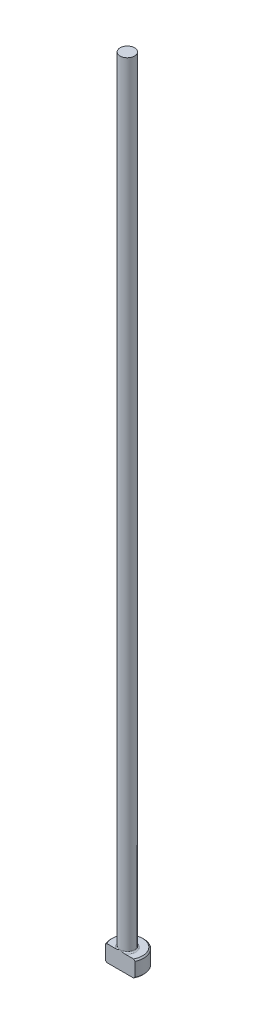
ISO-10303-21;
HEADER;
FILE_DESCRIPTION(('STEP AP214'),'2;1');
FILE_NAME('part.step','',(''),(''),'','','');
FILE_SCHEMA(('AUTOMOTIVE_DESIGN { 1 0 10303 214 1 1 1 1 }'));
ENDSEC;
DATA;
#1=APPLICATION_CONTEXT('core data for automotive mechanical design processes');
#2=APPLICATION_PROTOCOL_DEFINITION('international standard','automotive_design',2000,#1);
#3=PRODUCT_CONTEXT('',#1,'mechanical');
#4=PRODUCT('Part','Part','',(#3));
#5=PRODUCT_RELATED_PRODUCT_CATEGORY('part','',(#4));
#6=PRODUCT_DEFINITION_FORMATION('','',#4);
#7=PRODUCT_DEFINITION_CONTEXT('part definition',#1,'design');
#8=PRODUCT_DEFINITION('design','',#6,#7);
#9=PRODUCT_DEFINITION_SHAPE('','',#8);
#10=(LENGTH_UNIT() NAMED_UNIT(*) SI_UNIT(.MILLI.,.METRE.));
#11=(NAMED_UNIT(*) PLANE_ANGLE_UNIT() SI_UNIT($,.RADIAN.));
#12=(NAMED_UNIT(*) SI_UNIT($,.STERADIAN.) SOLID_ANGLE_UNIT());
#13=UNCERTAINTY_MEASURE_WITH_UNIT(LENGTH_MEASURE(1.E-05),#10,'distance_accuracy_value','');
#14=(GEOMETRIC_REPRESENTATION_CONTEXT(3) GLOBAL_UNCERTAINTY_ASSIGNED_CONTEXT((#13)) GLOBAL_UNIT_ASSIGNED_CONTEXT((#10,
#11,#12)) REPRESENTATION_CONTEXT('',''));
#15=CARTESIAN_POINT('',(0.,0.,0.));
#16=DIRECTION('',(0.,0.,1.));
#17=DIRECTION('',(1.,0.,0.));
#18=AXIS2_PLACEMENT_3D('',#15,#16,#17);
#19=CARTESIAN_POINT('',(0.,0.,0.));
#20=DIRECTION('',(0.,-1.,0.));
#21=DIRECTION('',(0.,0.,-1.));
#22=AXIS2_PLACEMENT_3D('',#19,#20,#21);
#23=PLANE('',#22);
#24=CARTESIAN_POINT('',(0.,0.,0.));
#25=DIRECTION('',(0.,-1.,0.));
#26=DIRECTION('',(0.,0.,-1.));
#27=AXIS2_PLACEMENT_3D('',#24,#25,#26);
#28=CIRCLE('',#27,2.92099999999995);
#29=CARTESIAN_POINT('',(-2.57009564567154,0.,1.38810999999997));
#30=VERTEX_POINT('',#29);
#31=CARTESIAN_POINT('',(2.57009564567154,0.,1.38810999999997));
#32=VERTEX_POINT('',#31);
#33=EDGE_CURVE('E98',#30,#32,#28,.T.);
#34=ORIENTED_EDGE('',*,*,#33,.T.);
#35=DIRECTION('',(-1.,0.,0.));
#36=VECTOR('',#35,1.);
#37=CARTESIAN_POINT('',(-2.85548168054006,0.,1.38810999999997));
#38=LINE('',#37,#36);
#39=EDGE_CURVE('E83',#32,#30,#38,.T.);
#40=ORIENTED_EDGE('',*,*,#39,.T.);
#41=EDGE_LOOP('',(#34,#40));
#42=FACE_BOUND('',#41,.T.);
#43=ADVANCED_FACE('F32',(#42),#23,.T.);
#44=CARTESIAN_POINT('',(0.,259.958771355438,0.));
#45=DIRECTION('',(0.,1.,0.));
#46=DIRECTION('',(0.,0.,1.));
#47=AXIS2_PLACEMENT_3D('',#44,#45,#46);
#48=CYLINDRICAL_SURFACE('',#47,3.17499999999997);
#49=CARTESIAN_POINT('',(0.,2.92099999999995,0.));
#50=DIRECTION('',(0.,1.,0.));
#51=DIRECTION('',(0.,0.,1.));
#52=AXIS2_PLACEMENT_3D('',#49,#50,#51);
#53=CIRCLE('',#52,3.17499999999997);
#54=CARTESIAN_POINT('',(-2.85548168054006,2.92099999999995,1.38810999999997));
#55=VERTEX_POINT('',#54);
#56=CARTESIAN_POINT('',(2.85548168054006,2.92099999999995,1.38810999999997));
#57=VERTEX_POINT('',#56);
#58=EDGE_CURVE('E104',#55,#57,#53,.F.);
#59=ORIENTED_EDGE('',*,*,#58,.T.);
#60=DIRECTION('',(0.,-1.,0.));
#61=VECTOR('',#60,1.);
#62=CARTESIAN_POINT('',(2.85548168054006,152.4,1.38810999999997));
#63=LINE('',#62,#61);
#64=CARTESIAN_POINT('',(2.85548168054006,0.254000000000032,1.38810999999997));
#65=VERTEX_POINT('',#64);
#66=EDGE_CURVE('E183',#57,#65,#63,.T.);
#67=ORIENTED_EDGE('',*,*,#66,.T.);
#68=CARTESIAN_POINT('',(0.,0.254000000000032,0.));
#69=DIRECTION('',(0.,-1.,0.));
#70=DIRECTION('',(0.,0.,-1.));
#71=AXIS2_PLACEMENT_3D('',#68,#69,#70);
#72=CIRCLE('',#71,3.17499999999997);
#73=CARTESIAN_POINT('',(-2.85548168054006,0.254000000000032,1.38810999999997));
#74=VERTEX_POINT('',#73);
#75=EDGE_CURVE('E100',#65,#74,#72,.F.);
#76=ORIENTED_EDGE('',*,*,#75,.T.);
#77=DIRECTION('',(0.,-1.,0.));
#78=VECTOR('',#77,1.);
#79=CARTESIAN_POINT('',(-2.85548168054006,152.4,1.38810999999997));
#80=LINE('',#79,#78);
#81=EDGE_CURVE('E93',#55,#74,#80,.T.);
#82=ORIENTED_EDGE('',*,*,#81,.F.);
#83=EDGE_LOOP('',(#59,#67,#76,#82));
#84=FACE_BOUND('',#83,.T.);
#85=ADVANCED_FACE('F158',(#84),#48,.T.);
#86=CARTESIAN_POINT('',(-3.17499999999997,3.175,0.));
#87=DIRECTION('',(0.,1.,0.));
#88=DIRECTION('',(0.,0.,1.));
#89=AXIS2_PLACEMENT_3D('',#86,#87,#88);
#90=PLANE('',#89);
#91=CARTESIAN_POINT('',(0.,3.175,0.));
#92=DIRECTION('',(0.,1.,0.));
#93=DIRECTION('',(0.,0.,1.));
#94=AXIS2_PLACEMENT_3D('',#91,#92,#93);
#95=CIRCLE('',#94,2.92099999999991);
#96=CARTESIAN_POINT('',(2.57009564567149,3.175,1.38810999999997));
#97=VERTEX_POINT('',#96);
#98=CARTESIAN_POINT('',(-2.57009564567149,3.175,1.38810999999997));
#99=VERTEX_POINT('',#98);
#100=EDGE_CURVE('E178',#97,#99,#95,.T.);
#101=ORIENTED_EDGE('',*,*,#100,.T.);
#102=DIRECTION('',(1.,0.,0.));
#103=VECTOR('',#102,1.);
#104=CARTESIAN_POINT('',(-3.17499999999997,3.175,1.38810999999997));
#105=LINE('',#104,#103);
#106=CARTESIAN_POINT('',(-0.877311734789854,3.17500000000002,1.38810999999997));
#107=VERTEX_POINT('',#106);
#108=EDGE_CURVE('E57',#99,#107,#105,.T.);
#109=ORIENTED_EDGE('',*,*,#108,.T.);
#110=CARTESIAN_POINT('',(0.,3.175,0.));
#111=DIRECTION('',(0.,1.,0.));
#112=DIRECTION('',(0.,0.,1.));
#113=AXIS2_PLACEMENT_3D('',#110,#111,#112);
#114=CIRCLE('',#113,1.64210999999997);
#115=CARTESIAN_POINT('',(0.877311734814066,3.17500000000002,1.38810999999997));
#116=VERTEX_POINT('',#115);
#117=EDGE_CURVE('E107',#107,#116,#114,.F.);
#118=ORIENTED_EDGE('',*,*,#117,.T.);
#119=EDGE_CURVE('E136',#116,#97,#105,.T.);
#120=ORIENTED_EDGE('',*,*,#119,.T.);
#121=EDGE_LOOP('',(#101,#109,#118,#120));
#122=FACE_BOUND('',#121,.T.);
#123=ADVANCED_FACE('F147',(#122),#90,.T.);
#124=CARTESIAN_POINT('',(0.,3.17499999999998,0.));
#125=DIRECTION('',(0.,-1.,0.));
#126=DIRECTION('',(0.,0.,-1.));
#127=AXIS2_PLACEMENT_3D('',#124,#125,#126);
#128=CONICAL_SURFACE('',#127,2.92099999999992,0.785398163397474);
#129=ORIENTED_EDGE('',*,*,#58,.F.);
#130=CARTESIAN_POINT('',(-6.28564708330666,-0.341096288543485,1.38810999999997));
#131=CARTESIAN_POINT('',(-6.10284652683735,-0.162614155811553,1.38810999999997));
#132=CARTESIAN_POINT('',(-5.91988120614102,0.0157000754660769,1.38810999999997));
#133=CARTESIAN_POINT('',(-5.55345852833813,0.371854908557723,1.38810999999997));
#134=CARTESIAN_POINT('',(-5.3700011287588,0.549695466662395,1.38810999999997));
#135=CARTESIAN_POINT('',(-5.00187064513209,0.905306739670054,1.38810999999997));
#136=CARTESIAN_POINT('',(-4.81719554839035,1.08307537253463,1.38810999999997));
#137=CARTESIAN_POINT('',(-4.4469952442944,1.43769779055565,1.38810999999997));
#138=CARTESIAN_POINT('',(-4.26147010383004,1.61455164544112,1.38810999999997));
#139=CARTESIAN_POINT('',(-3.88362079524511,1.97222321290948,1.38810999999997));
#140=CARTESIAN_POINT('',(-3.69125916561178,2.15300138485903,1.38810999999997));
#141=CARTESIAN_POINT('',(-3.3045187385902,2.5124917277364,1.38810999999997));
#142=CARTESIAN_POINT('',(-3.1101394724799,2.69120339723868,1.38810999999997));
#143=CARTESIAN_POINT('',(-2.8163107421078,2.95645878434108,1.38810999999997));
#144=CARTESIAN_POINT('',(-2.71807004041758,3.04433993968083,1.38810999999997));
#145=CARTESIAN_POINT('',(-2.52052325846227,3.21889482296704,1.38810999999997));
#146=CARTESIAN_POINT('',(-2.42121720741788,3.30556858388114,1.38810999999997));
#147=CARTESIAN_POINT('',(-2.2212138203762,3.47722044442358,1.38810999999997));
#148=CARTESIAN_POINT('',(-2.12051703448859,3.56219918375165,1.38810999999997));
#149=CARTESIAN_POINT('',(-1.91716426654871,3.72977349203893,1.38810999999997));
#150=CARTESIAN_POINT('',(-1.8145085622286,3.81236939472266,1.38810999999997));
#151=CARTESIAN_POINT('',(-1.6810053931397,3.9160251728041,1.38810999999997));
#152=CARTESIAN_POINT('',(-1.65144552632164,3.93874478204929,1.38810999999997));
#153=CARTESIAN_POINT('',(-1.59207253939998,3.98385163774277,1.38810999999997));
#154=CARTESIAN_POINT('',(-1.56225941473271,4.0062388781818,1.38810999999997));
#155=CARTESIAN_POINT('',(-1.47239383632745,4.07284133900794,1.38810999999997));
#156=CARTESIAN_POINT('',(-1.41192070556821,4.11649298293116,1.38810999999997));
#157=CARTESIAN_POINT('',(-1.28948482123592,4.20187960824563,1.38810999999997));
#158=CARTESIAN_POINT('',(-1.22751984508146,4.24361142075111,1.38810999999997));
#159=CARTESIAN_POINT('',(-1.10185796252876,4.32438548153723,1.38810999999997));
#160=CARTESIAN_POINT('',(-1.03816127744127,4.36342807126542,1.38810999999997));
#161=CARTESIAN_POINT('',(-0.922245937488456,4.4299743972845,1.38810999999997));
#162=CARTESIAN_POINT('',(-0.870434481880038,4.45817678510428,1.38810999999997));
#163=CARTESIAN_POINT('',(-0.765291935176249,4.51155718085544,1.38810999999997));
#164=CARTESIAN_POINT('',(-0.711960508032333,4.53673451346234,1.38810999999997));
#165=CARTESIAN_POINT('',(-0.549736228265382,4.60617267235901,1.38810999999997));
#166=CARTESIAN_POINT('',(-0.438073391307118,4.64467095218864,1.38810999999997));
#167=CARTESIAN_POINT('',(-0.282988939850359,4.6798931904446,1.38810999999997));
#168=CARTESIAN_POINT('',(-0.241996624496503,4.68754634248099,1.38810999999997));
#169=CARTESIAN_POINT('',(-0.159518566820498,4.6993490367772,1.38810999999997));
#170=CARTESIAN_POINT('',(-0.118033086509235,4.70350036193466,1.38810999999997));
#171=CARTESIAN_POINT('',(-0.0349115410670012,4.70806989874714,1.38810999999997));
#172=CARTESIAN_POINT('',(0.00672423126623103,4.70849333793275,1.38810999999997));
#173=CARTESIAN_POINT('',(0.0898582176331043,4.70560715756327,1.38810999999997));
#174=CARTESIAN_POINT('',(0.131356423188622,4.70229731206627,1.38810999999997));
#175=CARTESIAN_POINT('',(0.254710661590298,4.68705332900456,1.38810999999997));
#176=CARTESIAN_POINT('',(0.335954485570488,4.66983040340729,1.38810999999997));
#177=CARTESIAN_POINT('',(0.455350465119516,4.63562019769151,1.38810999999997));
#178=CARTESIAN_POINT('',(0.494808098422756,4.62278932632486,1.38810999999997));
#179=CARTESIAN_POINT('',(0.572878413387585,4.59476081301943,1.38810999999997));
#180=CARTESIAN_POINT('',(0.611491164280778,4.57956336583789,1.38810999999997));
#181=CARTESIAN_POINT('',(0.709005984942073,4.53823145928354,1.38810999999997));
#182=CARTESIAN_POINT('',(0.767311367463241,4.51069858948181,1.38810999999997));
#183=CARTESIAN_POINT('',(0.882112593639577,4.45206049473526,1.38810999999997));
#184=CARTESIAN_POINT('',(0.938607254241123,4.42095299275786,1.38810999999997));
#185=CARTESIAN_POINT('',(1.05015064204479,4.35599862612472,1.38810999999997));
#186=CARTESIAN_POINT('',(1.10519597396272,4.32214597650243,1.38810999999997));
#187=CARTESIAN_POINT('',(1.21398242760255,4.25239829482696,1.38810999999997));
#188=CARTESIAN_POINT('',(1.26772328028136,4.21650284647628,1.38810999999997));
#189=CARTESIAN_POINT('',(1.42883400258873,4.10545853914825,1.38810999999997));
#190=CARTESIAN_POINT('',(1.53453668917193,4.02789415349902,1.38810999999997));
#191=CARTESIAN_POINT('',(1.69073785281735,3.90868590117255,1.38810999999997));
#192=CARTESIAN_POINT('',(1.74237763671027,3.86850183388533,1.38810999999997));
#193=CARTESIAN_POINT('',(1.84502134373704,3.78732919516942,1.38810999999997));
#194=CARTESIAN_POINT('',(1.89602528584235,3.7463406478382,1.38810999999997));
#195=CARTESIAN_POINT('',(2.04728489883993,3.62318630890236,1.38810999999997));
#196=CARTESIAN_POINT('',(2.14676862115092,3.54007426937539,1.38810999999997));
#197=CARTESIAN_POINT('',(2.34424659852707,3.37209474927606,1.38810999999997));
#198=CARTESIAN_POINT('',(2.44224074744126,3.28722714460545,1.38810999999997));
#199=CARTESIAN_POINT('',(2.63713730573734,3.11620836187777,1.38810999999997));
#200=CARTESIAN_POINT('',(2.73403947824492,3.03005691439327,1.38810999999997));
#201=CARTESIAN_POINT('',(2.92699596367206,2.8568086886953,1.38810999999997));
#202=CARTESIAN_POINT('',(3.02305026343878,2.76971189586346,1.38810999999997));
#203=CARTESIAN_POINT('',(3.31050843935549,2.50710290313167,1.38810999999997));
#204=CARTESIAN_POINT('',(3.50093094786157,2.33051735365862,1.38810999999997));
#205=CARTESIAN_POINT('',(3.88009790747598,1.97561018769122,1.38810999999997));
#206=CARTESIAN_POINT('',(4.06884257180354,1.7972887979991,1.38810999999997));
#207=CARTESIAN_POINT('',(4.42755841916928,1.45624400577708,1.38810999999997));
#208=CARTESIAN_POINT('',(4.5976301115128,1.29362623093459,1.38810999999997));
#209=CARTESIAN_POINT('',(4.93710695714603,0.967683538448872,1.38810999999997));
#210=CARTESIAN_POINT('',(5.10651208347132,0.804358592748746,1.38810999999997));
#211=CARTESIAN_POINT('',(5.44442829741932,0.477566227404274,1.38810999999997));
#212=CARTESIAN_POINT('',(5.61294054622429,0.314100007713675,1.38810999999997));
#213=CARTESIAN_POINT('',(5.94956476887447,-0.0132280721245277,1.38810999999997));
#214=CARTESIAN_POINT('',(6.11767676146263,-0.177089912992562,1.38810999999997));
#215=CARTESIAN_POINT('',(6.28564708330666,-0.341096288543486,1.38810999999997));
#216=B_SPLINE_CURVE_WITH_KNOTS('',3,(#130,#131,#132,#133,#134,#135,#136,#137,#138,#139,#140,
#141,#142,#143,#144,#145,#146,#147,#148,#149,#150,#151,#152,#153,#154,#155,#156,#157,#158,#159,
#160,#161,#162,#163,#164,#165,#166,#167,#168,#169,#170,#171,#172,#173,#174,#175,#176,#177,#178,
#179,#180,#181,#182,#183,#184,#185,#186,#187,#188,#189,#190,#191,#192,#193,#194,#195,#196,#197,
#198,#199,#200,#201,#202,#203,#204,#205,#206,#207,#208,#209,#210,#211,#212,#213,#214,#215),
.UNSPECIFIED.,.F.,.F.,(4,2,2,2,2,2,2,2,2,2,2,2,2,2,2,2,2,2,2,2,2,2,2,2,2,2,2,2,2,2,2,2,2,2,2,2,
2,2,2,2,2,2,4),(0.,0.766451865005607,1.532972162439,2.301968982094,3.07090629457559,
3.86282911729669,4.65494022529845,5.0503687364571,5.44578642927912,5.84105195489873,
6.2362618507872,6.34810657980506,6.45995332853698,6.68366785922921,6.90773929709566,
7.13178223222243,7.30865086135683,7.48555890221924,7.83748452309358,7.96246290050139,
8.08737760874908,8.21211712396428,8.33686418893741,8.58479396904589,8.70921946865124,
8.83363473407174,9.02689908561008,9.22028723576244,9.41409407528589,9.60794055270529,
10.0010794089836,10.1973757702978,10.3936662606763,10.7825319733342,11.1714252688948,
11.560401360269,11.949383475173,12.7284567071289,13.5074294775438,14.2133446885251,
14.9192881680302,15.6236014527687,16.3278810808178),.UNSPECIFIED.);
#217=EDGE_CURVE('E135',#55,#99,#216,.T.);
#218=ORIENTED_EDGE('',*,*,#217,.T.);
#219=ORIENTED_EDGE('',*,*,#100,.F.);
#220=EDGE_CURVE('E127',#97,#57,#216,.T.);
#221=ORIENTED_EDGE('',*,*,#220,.T.);
#222=EDGE_LOOP('',(#129,#218,#219,#221));
#223=FACE_BOUND('',#222,.T.);
#224=ADVANCED_FACE('F143',(#223),#128,.T.);
#225=CARTESIAN_POINT('',(0.,0.254000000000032,0.));
#226=DIRECTION('',(0.,1.,0.));
#227=DIRECTION('',(0.,0.,1.));
#228=AXIS2_PLACEMENT_3D('',#225,#226,#227);
#229=CONICAL_SURFACE('',#228,3.17499999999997,0.785398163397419);
#230=ORIENTED_EDGE('',*,*,#75,.F.);
#231=CARTESIAN_POINT('',(6.28564708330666,3.51609628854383,1.38810999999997));
#232=CARTESIAN_POINT('',(6.10284652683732,3.33761415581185,1.38810999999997));
#233=CARTESIAN_POINT('',(5.91988120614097,3.15929992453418,1.38810999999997));
#234=CARTESIAN_POINT('',(5.55345852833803,2.80314509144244,1.38810999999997));
#235=CARTESIAN_POINT('',(5.37000112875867,2.62530453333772,1.38810999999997));
#236=CARTESIAN_POINT('',(5.0018706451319,2.26969326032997,1.38810999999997));
#237=CARTESIAN_POINT('',(4.81719554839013,2.09192462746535,1.38810999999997));
#238=CARTESIAN_POINT('',(4.44699524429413,1.73730220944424,1.38810999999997));
#239=CARTESIAN_POINT('',(4.26147010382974,1.56044835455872,1.38810999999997));
#240=CARTESIAN_POINT('',(3.88362079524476,1.20277678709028,1.38810999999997));
#241=CARTESIAN_POINT('',(3.6912591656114,1.02199861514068,1.38810999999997));
#242=CARTESIAN_POINT('',(3.30451873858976,0.662508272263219,1.38810999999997));
#243=CARTESIAN_POINT('',(3.11013947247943,0.4837966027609,1.38810999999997));
#244=CARTESIAN_POINT('',(2.81631074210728,0.218541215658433,1.38810999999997));
#245=CARTESIAN_POINT('',(2.71807004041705,0.130660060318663,1.38810999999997));
#246=CARTESIAN_POINT('',(2.5205232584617,-0.0438948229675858,1.38810999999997));
#247=CARTESIAN_POINT('',(2.4212172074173,-0.130568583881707,1.38810999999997));
#248=CARTESIAN_POINT('',(2.22121382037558,-0.302220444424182,1.38810999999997));
#249=CARTESIAN_POINT('',(2.12051703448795,-0.387199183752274,1.38810999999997));
#250=CARTESIAN_POINT('',(1.91716426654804,-0.554773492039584,1.38810999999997));
#251=CARTESIAN_POINT('',(1.81450856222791,-0.637369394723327,1.38810999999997));
#252=CARTESIAN_POINT('',(1.68100539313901,-0.741025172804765,1.38810999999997));
#253=CARTESIAN_POINT('',(1.65144552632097,-0.763744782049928,1.38810999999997));
#254=CARTESIAN_POINT('',(1.59207253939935,-0.808851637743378,1.38810999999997));
#255=CARTESIAN_POINT('',(1.56225941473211,-0.831238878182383,1.38810999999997));
#256=CARTESIAN_POINT('',(1.47239383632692,-0.897841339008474,1.38810999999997));
#257=CARTESIAN_POINT('',(1.41192070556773,-0.941492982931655,1.38810999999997));
#258=CARTESIAN_POINT('',(1.28948482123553,-1.02687960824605,1.38810999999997));
#259=CARTESIAN_POINT('',(1.22751984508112,-1.0686114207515,1.38810999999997));
#260=CARTESIAN_POINT('',(1.10185796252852,-1.14938548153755,1.38810999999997));
#261=CARTESIAN_POINT('',(1.03816127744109,-1.18842807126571,1.38810999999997));
#262=CARTESIAN_POINT('',(0.922245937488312,-1.25497439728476,1.38810999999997));
#263=CARTESIAN_POINT('',(0.870434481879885,-1.28317678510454,1.38810999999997));
#264=CARTESIAN_POINT('',(0.765291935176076,-1.33655718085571,1.38810999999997));
#265=CARTESIAN_POINT('',(0.71196050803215,-1.36173451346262,1.38810999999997));
#266=CARTESIAN_POINT('',(0.549736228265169,-1.43117267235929,1.38810999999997));
#267=CARTESIAN_POINT('',(0.438073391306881,-1.46967095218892,1.38810999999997));
#268=CARTESIAN_POINT('',(0.282988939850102,-1.50489319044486,1.38810999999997));
#269=CARTESIAN_POINT('',(0.241996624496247,-1.51254634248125,1.38810999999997));
#270=CARTESIAN_POINT('',(0.159518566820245,-1.52434903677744,1.38810999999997));
#271=CARTESIAN_POINT('',(0.118033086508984,-1.5285003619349,1.38810999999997));
#272=CARTESIAN_POINT('',(0.0349115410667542,-1.53306989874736,1.38810999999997));
#273=CARTESIAN_POINT('',(-0.00672423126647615,-1.53349333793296,1.38810999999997));
#274=CARTESIAN_POINT('',(-0.0898582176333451,-1.53060715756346,1.38810999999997));
#275=CARTESIAN_POINT('',(-0.13135642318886,-1.52729731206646,1.38810999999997));
#276=CARTESIAN_POINT('',(-0.254710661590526,-1.51205332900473,1.38810999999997));
#277=CARTESIAN_POINT('',(-0.335954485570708,-1.49483040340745,1.38810999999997));
#278=CARTESIAN_POINT('',(-0.455350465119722,-1.46062019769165,1.38810999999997));
#279=CARTESIAN_POINT('',(-0.494808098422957,-1.447789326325,1.38810999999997));
#280=CARTESIAN_POINT('',(-0.572878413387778,-1.41976081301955,1.38810999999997));
#281=CARTESIAN_POINT('',(-0.611491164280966,-1.40456336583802,1.38810999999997));
#282=CARTESIAN_POINT('',(-0.709005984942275,-1.36323145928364,1.38810999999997));
#283=CARTESIAN_POINT('',(-0.76731136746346,-1.3356985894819,1.38810999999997));
#284=CARTESIAN_POINT('',(-0.882112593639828,-1.27706049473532,1.38810999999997));
#285=CARTESIAN_POINT('',(-0.93860725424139,-1.24595299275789,1.38810999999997));
#286=CARTESIAN_POINT('',(-1.05015064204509,-1.18099862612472,1.38810999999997));
#287=CARTESIAN_POINT('',(-1.10519597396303,-1.14714597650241,1.38810999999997));
#288=CARTESIAN_POINT('',(-1.21398242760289,-1.0773982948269,1.38810999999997));
#289=CARTESIAN_POINT('',(-1.26772328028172,-1.0415028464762,1.38810999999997));
#290=CARTESIAN_POINT('',(-1.42883400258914,-0.930458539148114,1.38810999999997));
#291=CARTESIAN_POINT('',(-1.53453668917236,-0.852894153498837,1.38810999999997));
#292=CARTESIAN_POINT('',(-1.69073785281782,-0.73368590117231,1.38810999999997));
#293=CARTESIAN_POINT('',(-1.74237763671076,-0.693501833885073,1.38810999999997));
#294=CARTESIAN_POINT('',(-1.84502134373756,-0.612329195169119,1.38810999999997));
#295=CARTESIAN_POINT('',(-1.89602528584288,-0.571340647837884,1.38810999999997));
#296=CARTESIAN_POINT('',(-2.04728489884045,-0.448186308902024,1.38810999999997));
#297=CARTESIAN_POINT('',(-2.14676862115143,-0.36507426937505,1.38810999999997));
#298=CARTESIAN_POINT('',(-2.34424659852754,-0.197094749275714,1.38810999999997));
#299=CARTESIAN_POINT('',(-2.44224074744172,-0.112227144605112,1.38810999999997));
#300=CARTESIAN_POINT('',(-2.63713730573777,0.0587916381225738,1.38810999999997));
#301=CARTESIAN_POINT('',(-2.73403947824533,0.14494308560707,1.38810999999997));
#302=CARTESIAN_POINT('',(-2.92699596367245,0.318191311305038,1.38810999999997));
#303=CARTESIAN_POINT('',(-3.02305026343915,0.405288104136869,1.38810999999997));
#304=CARTESIAN_POINT('',(-3.31050843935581,0.667897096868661,1.38810999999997));
#305=CARTESIAN_POINT('',(-3.50093094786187,0.844482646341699,1.38810999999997));
#306=CARTESIAN_POINT('',(-3.88009790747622,1.19938981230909,1.38810999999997));
#307=CARTESIAN_POINT('',(-4.06884257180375,1.3777112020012,1.38810999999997));
#308=CARTESIAN_POINT('',(-4.42755841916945,1.71875599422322,1.38810999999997));
#309=CARTESIAN_POINT('',(-4.59763011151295,1.88137376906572,1.38810999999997));
#310=CARTESIAN_POINT('',(-4.93710695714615,2.20731646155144,1.38810999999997));
#311=CARTESIAN_POINT('',(-5.10651208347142,2.37064140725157,1.38810999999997));
#312=CARTESIAN_POINT('',(-5.44442829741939,2.69743377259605,1.38810999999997));
#313=CARTESIAN_POINT('',(-5.61294054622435,2.86089999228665,1.38810999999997));
#314=CARTESIAN_POINT('',(-5.9495647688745,3.18822807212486,1.38810999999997));
#315=CARTESIAN_POINT('',(-6.11767676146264,3.3520899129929,1.38810999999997));
#316=CARTESIAN_POINT('',(-6.28564708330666,3.51609628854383,1.38810999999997));
#317=B_SPLINE_CURVE_WITH_KNOTS('',3,(#231,#232,#233,#234,#235,#236,#237,#238,#239,#240,#241,
#242,#243,#244,#245,#246,#247,#248,#249,#250,#251,#252,#253,#254,#255,#256,#257,#258,#259,#260,
#261,#262,#263,#264,#265,#266,#267,#268,#269,#270,#271,#272,#273,#274,#275,#276,#277,#278,#279,
#280,#281,#282,#283,#284,#285,#286,#287,#288,#289,#290,#291,#292,#293,#294,#295,#296,#297,#298,
#299,#300,#301,#302,#303,#304,#305,#306,#307,#308,#309,#310,#311,#312,#313,#314,#315,#316),
.UNSPECIFIED.,.F.,.F.,(4,2,2,2,2,2,2,2,2,2,2,2,2,2,2,2,2,2,2,2,2,2,2,2,2,2,2,2,2,2,2,2,2,2,2,2,
2,2,2,2,2,2,4),(0.,0.766451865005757,1.5329721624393,2.30196898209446,3.0709062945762,
3.86282911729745,4.65494022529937,5.0503687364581,5.44578642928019,5.84105195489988,
6.23626185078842,6.3481065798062,6.45995332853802,6.68366785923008,6.90773929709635,
7.13178223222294,7.30865086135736,7.4855589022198,7.83748452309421,7.96246290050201,
8.08737760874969,8.21211712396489,8.33686418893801,8.58479396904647,8.70921946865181,
8.83363473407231,9.02689908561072,9.22028723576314,9.41409407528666,9.60794055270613,
10.0010794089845,10.1973757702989,10.3936662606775,10.7825319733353,11.1714252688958,
11.56040136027,11.949383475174,12.7284567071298,13.5074294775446,14.2133446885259,
14.919288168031,15.6236014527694,16.3278810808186),.UNSPECIFIED.);
#318=EDGE_CURVE('E86',#65,#32,#317,.T.);
#319=ORIENTED_EDGE('',*,*,#318,.T.);
#320=ORIENTED_EDGE('',*,*,#33,.F.);
#321=EDGE_CURVE('E89',#30,#74,#317,.T.);
#322=ORIENTED_EDGE('',*,*,#321,.T.);
#323=EDGE_LOOP('',(#230,#319,#320,#322));
#324=FACE_BOUND('',#323,.T.);
#325=ADVANCED_FACE('F97',(#324),#229,.T.);
#326=CARTESIAN_POINT('',(0.,3.42900000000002,0.));
#327=DIRECTION('',(0.,1.,0.));
#328=DIRECTION('',(0.,0.,1.));
#329=AXIS2_PLACEMENT_3D('',#326,#327,#328);
#330=TOROIDAL_SURFACE('',#329,1.64210999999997,0.254);
#331=CARTESIAN_POINT('',(0.,3.42900000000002,1.38810999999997));
#332=CARTESIAN_POINT('',(-3.34377710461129E-11,3.42900057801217,1.38810999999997));
#333=CARTESIAN_POINT('',(1.12127784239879E-07,3.42900115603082,1.38810999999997));
#334=CARTESIAN_POINT('',(4.73075032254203E-07,3.42900227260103,1.38810999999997));
#335=CARTESIAN_POINT('',(7.24883233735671E-07,3.42900280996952,1.38810999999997));
#336=CARTESIAN_POINT('',(1.33159580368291E-06,3.42900387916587,1.38810999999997));
#337=CARTESIAN_POINT('',(1.69309533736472E-06,3.42900440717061,1.38810999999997));
#338=CARTESIAN_POINT('',(2.47644248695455E-06,3.42900540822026,1.38810999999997));
#339=CARTESIAN_POINT('',(2.89785813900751E-06,3.42900588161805,1.38810999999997));
#340=CARTESIAN_POINT('',(4.39686632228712E-06,3.42900745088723,1.38810999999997));
#341=CARTESIAN_POINT('',(5.5535203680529E-06,3.4290084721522,1.38810999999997));
#342=CARTESIAN_POINT('',(7.95624669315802E-06,3.42901030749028,1.38810999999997));
#343=CARTESIAN_POINT('',(9.1983432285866E-06,3.42901112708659,1.38810999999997));
#344=CARTESIAN_POINT('',(1.39959283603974E-05,3.42901416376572,1.38810999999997));
#345=CARTESIAN_POINT('',(1.76589529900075E-05,3.42901621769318,1.38810999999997));
#346=CARTESIAN_POINT('',(2.49218935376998E-05,3.42901961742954,1.38810999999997));
#347=CARTESIAN_POINT('',(2.85015930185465E-05,3.42902100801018,1.38810999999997));
#348=CARTESIAN_POINT('',(4.36111509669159E-05,3.42902684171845,1.38810999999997));
#349=CARTESIAN_POINT('',(5.51613438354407E-05,3.42903121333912,1.38810999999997));
#350=CARTESIAN_POINT('',(7.68645571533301E-05,3.42903830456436,1.38810999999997));
#351=CARTESIAN_POINT('',(8.69667922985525E-05,3.42904117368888,1.38810999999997));
#352=CARTESIAN_POINT('',(0.000159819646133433,3.42906370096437,1.38810999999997));
#353=CARTESIAN_POINT('',(0.000219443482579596,3.42909214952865,1.38810999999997));
#354=CARTESIAN_POINT('',(0.000450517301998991,3.42919832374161,1.38810999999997));
#355=CARTESIAN_POINT('',(0.000624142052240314,3.42926951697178,1.38810999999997));
#356=CARTESIAN_POINT('',(0.00129542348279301,3.42954891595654,1.38810999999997));
#357=CARTESIAN_POINT('',(0.00179084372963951,3.42976397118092,1.38810999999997));
#358=CARTESIAN_POINT('',(0.00380622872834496,3.43063457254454,1.38810999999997));
#359=CARTESIAN_POINT('',(0.00532866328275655,3.43128241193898,1.38810999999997));
#360=CARTESIAN_POINT('',(0.0281608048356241,3.44100336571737,1.38810999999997));
#361=CARTESIAN_POINT('',(0.0494517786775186,3.4501364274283,1.38810999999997));
#362=CARTESIAN_POINT('',(0.0913153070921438,3.46795329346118,1.38810999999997));
#363=CARTESIAN_POINT('',(0.111886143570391,3.47664143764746,1.38810999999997));
#364=CARTESIAN_POINT('',(0.155438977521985,3.49485457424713,1.38810999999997));
#365=CARTESIAN_POINT('',(0.178428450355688,3.50436202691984,1.38810999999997));
#366=CARTESIAN_POINT('',(0.224756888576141,3.52317246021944,1.38810999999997));
#367=CARTESIAN_POINT('',(0.24809705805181,3.53247247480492,1.38810999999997));
#368=CARTESIAN_POINT('',(0.306417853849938,3.55511793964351,1.38810999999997));
#369=CARTESIAN_POINT('',(0.341497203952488,3.56821221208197,1.38810999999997));
#370=CARTESIAN_POINT('',(0.411329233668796,3.592794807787,1.38810999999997));
#371=CARTESIAN_POINT('',(0.446071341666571,3.60431276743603,1.38810999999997));
#372=CARTESIAN_POINT('',(0.511339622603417,3.62419422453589,1.38810999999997));
#373=CARTESIAN_POINT('',(0.541799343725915,3.63277367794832,1.38810999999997));
#374=CARTESIAN_POINT('',(0.603329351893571,3.64836415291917,1.38810999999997));
#375=CARTESIAN_POINT('',(0.634402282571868,3.65536490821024,1.38810999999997));
#376=CARTESIAN_POINT('',(0.698594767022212,3.66762743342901,1.38810999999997));
#377=CARTESIAN_POINT('',(0.731736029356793,3.67277841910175,1.38810999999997));
#378=CARTESIAN_POINT('',(0.798335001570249,3.68020027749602,1.38810999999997));
#379=CARTESIAN_POINT('',(0.831792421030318,3.6824735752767,1.38810999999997));
#380=CARTESIAN_POINT('',(0.891608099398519,3.68326999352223,1.38810999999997));
#381=CARTESIAN_POINT('',(0.917954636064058,3.68249105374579,1.38810999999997));
#382=CARTESIAN_POINT('',(0.970220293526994,3.67820021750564,1.38810999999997));
#383=CARTESIAN_POINT('',(0.996141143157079,3.67471169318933,1.38810999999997));
#384=CARTESIAN_POINT('',(1.04772208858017,3.66435642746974,1.38810999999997));
#385=CARTESIAN_POINT('',(1.07337274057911,3.65744074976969,1.38810999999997));
#386=CARTESIAN_POINT('',(1.12322278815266,3.63939937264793,1.38810999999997));
#387=CARTESIAN_POINT('',(1.1474239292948,3.62827885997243,1.38810999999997));
#388=CARTESIAN_POINT('',(1.18237685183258,3.60723568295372,1.38810999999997));
#389=CARTESIAN_POINT('',(1.19420638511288,3.59910277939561,1.38810999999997));
#390=CARTESIAN_POINT('',(1.21658550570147,3.58122650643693,1.38810999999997));
#391=CARTESIAN_POINT('',(1.22713672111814,3.57148522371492,1.38810999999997));
#392=CARTESIAN_POINT('',(1.24490628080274,3.55203508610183,1.38810999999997));
#393=CARTESIAN_POINT('',(1.25238779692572,3.5425684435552,1.38810999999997));
#394=CARTESIAN_POINT('',(1.26569997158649,3.52253177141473,1.38810999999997));
#395=CARTESIAN_POINT('',(1.27153244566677,3.51196297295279,1.38810999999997));
#396=CARTESIAN_POINT('',(1.28039302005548,3.49165786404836,1.38810999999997));
#397=CARTESIAN_POINT('',(1.28371769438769,3.48205149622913,1.38810999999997));
#398=CARTESIAN_POINT('',(1.28870678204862,3.46241528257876,1.38810999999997));
#399=CARTESIAN_POINT('',(1.2903720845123,3.45238566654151,1.38810999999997));
#400=CARTESIAN_POINT('',(1.29192723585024,3.4321644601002,1.38810999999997));
#401=CARTESIAN_POINT('',(1.29181293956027,3.42197254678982,1.38810999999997));
#402=CARTESIAN_POINT('',(1.28980739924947,3.40176590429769,1.38810999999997));
#403=CARTESIAN_POINT('',(1.28791588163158,3.39175120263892,1.38810999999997));
#404=CARTESIAN_POINT('',(1.28257672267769,3.37249811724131,1.38810999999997));
#405=CARTESIAN_POINT('',(1.27918091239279,3.36324513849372,1.38810999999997));
#406=CARTESIAN_POINT('',(1.27104514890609,3.34535586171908,1.38810999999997));
#407=CARTESIAN_POINT('',(1.26630474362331,3.33671977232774,1.38810999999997));
#408=CARTESIAN_POINT('',(1.25357606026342,3.3168678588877,1.38810999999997));
#409=CARTESIAN_POINT('',(1.24504668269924,3.30599859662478,1.38810999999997));
#410=CARTESIAN_POINT('',(1.22634105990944,3.28577926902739,1.38810999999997));
#411=CARTESIAN_POINT('',(1.21616097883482,3.27643284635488,1.38810999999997));
#412=CARTESIAN_POINT('',(1.18998286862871,3.25552571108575,1.38810999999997));
#413=CARTESIAN_POINT('',(1.17336630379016,3.24474276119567,1.38810999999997));
#414=CARTESIAN_POINT('',(1.13870404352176,3.22591810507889,1.38810999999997));
#415=CARTESIAN_POINT('',(1.12065837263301,3.217876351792,1.38810999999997));
#416=CARTESIAN_POINT('',(1.07282497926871,3.20008649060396,1.38810999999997));
#417=CARTESIAN_POINT('',(1.04237965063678,3.19212159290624,1.38810999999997));
#418=CARTESIAN_POINT('',(0.980362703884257,3.18075532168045,1.38810999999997));
#419=CARTESIAN_POINT('',(0.948781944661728,3.17740997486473,1.38810999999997));
#420=CARTESIAN_POINT('',(0.887893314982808,3.17454615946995,1.38810999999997));
#421=CARTESIAN_POINT('',(0.858596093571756,3.17475489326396,1.38810999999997));
#422=CARTESIAN_POINT('',(0.800128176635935,3.17773341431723,1.38810999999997));
#423=CARTESIAN_POINT('',(0.770957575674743,3.18050486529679,1.38810999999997));
#424=CARTESIAN_POINT('',(0.714225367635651,3.18795519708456,1.38810999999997));
#425=CARTESIAN_POINT('',(0.686651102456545,3.19254122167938,1.38810999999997));
#426=CARTESIAN_POINT('',(0.631960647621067,3.20324375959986,1.38810999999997));
#427=CARTESIAN_POINT('',(0.604842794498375,3.20935193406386,1.38810999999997));
#428=CARTESIAN_POINT('',(0.535277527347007,3.22674477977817,1.38810999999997));
#429=CARTESIAN_POINT('',(0.493068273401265,3.23897621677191,1.38810999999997));
#430=CARTESIAN_POINT('',(0.408436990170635,3.26600552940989,1.38810999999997));
#431=CARTESIAN_POINT('',(0.366032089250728,3.28085560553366,1.38810999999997));
#432=CARTESIAN_POINT('',(0.295764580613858,3.30697342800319,1.38810999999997));
#433=CARTESIAN_POINT('',(0.267735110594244,3.31779960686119,1.38810999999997));
#434=CARTESIAN_POINT('',(0.212159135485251,3.33986232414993,1.38810999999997));
#435=CARTESIAN_POINT('',(0.184610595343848,3.35109374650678,1.38810999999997));
#436=CARTESIAN_POINT('',(0.132465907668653,3.37270024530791,1.38810999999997));
#437=CARTESIAN_POINT('',(0.107856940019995,3.38304489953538,1.38810999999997));
#438=CARTESIAN_POINT('',(0.0577879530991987,3.40430231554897,1.38810999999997));
#439=CARTESIAN_POINT('',(0.0323306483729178,3.41522182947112,1.38810999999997));
#440=CARTESIAN_POINT('',(0.00532814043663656,3.4267177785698,1.38810999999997));
#441=CARTESIAN_POINT('',(0.00380519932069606,3.42736585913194,1.38810999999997));
#442=CARTESIAN_POINT('',(0.00178969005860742,3.42823652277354,1.38810999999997));
#443=CARTESIAN_POINT('',(0.00129465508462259,3.4284514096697,1.38810999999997));
#444=CARTESIAN_POINT('',(0.000623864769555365,3.4287306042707,1.38810999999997));
#445=CARTESIAN_POINT('',(0.000450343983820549,3.42880175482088,1.38810999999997));
#446=CARTESIAN_POINT('',(0.000219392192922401,3.4289078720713,1.38810999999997));
#447=CARTESIAN_POINT('',(0.000159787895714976,3.42893631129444,1.38810999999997));
#448=CARTESIAN_POINT('',(8.69575228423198E-05,3.42895883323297,1.38810999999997));
#449=CARTESIAN_POINT('',(7.68568204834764E-05,3.42896170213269,1.38810999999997));
#450=CARTESIAN_POINT('',(5.51569463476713E-05,3.42896879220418,1.38810999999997));
#451=CARTESIAN_POINT('',(4.36085184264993E-05,3.42897316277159,1.38810999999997));
#452=CARTESIAN_POINT('',(2.85009435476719E-05,3.42897899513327,1.38810999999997));
#453=CARTESIAN_POINT('',(2.49214900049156E-05,3.42898038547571,1.38810999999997));
#454=CARTESIAN_POINT('',(1.76590073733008E-05,3.42898378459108,1.38810999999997));
#455=CARTESIAN_POINT('',(1.39961863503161E-05,3.42898583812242,1.38810999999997));
#456=CARTESIAN_POINT('',(9.19878976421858E-06,3.42898887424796,1.38810999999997));
#457=CARTESIAN_POINT('',(7.95671264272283E-06,3.42898969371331,1.38810999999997));
#458=CARTESIAN_POINT('',(5.55399882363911E-06,3.4289915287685,1.38810999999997));
#459=CARTESIAN_POINT('',(4.39733672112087E-06,3.42899254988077,1.38810999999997));
#460=CARTESIAN_POINT('',(2.89828588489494E-06,3.42899411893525,1.38810999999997));
#461=CARTESIAN_POINT('',(2.4768516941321E-06,3.42899459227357,1.38810999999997));
#462=CARTESIAN_POINT('',(1.69345685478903E-06,3.42899559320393,1.38810999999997));
#463=CARTESIAN_POINT('',(1.33192807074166E-06,3.42899612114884,1.38810999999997));
#464=CARTESIAN_POINT('',(7.25144631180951E-07,3.42899719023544,1.38810999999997));
#465=CARTESIAN_POINT('',(4.73296102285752E-07,3.42899772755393,1.38810999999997));
#466=CARTESIAN_POINT('',(1.12251299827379E-07,3.42899884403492,1.38810999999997));
#467=CARTESIAN_POINT('',(3.34362462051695E-11,3.42899942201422,1.38810999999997));
#468=CARTESIAN_POINT('',(0.,3.42900000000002,1.38810999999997));
#469=B_SPLINE_CURVE_WITH_KNOTS('',3,(#331,#332,#333,#334,#335,#336,#337,#338,#339,#340,#341,
#342,#343,#344,#345,#346,#347,#348,#349,#350,#351,#352,#353,#354,#355,#356,#357,#358,#359,#360,
#361,#362,#363,#364,#365,#366,#367,#368,#369,#370,#371,#372,#373,#374,#375,#376,#377,#378,#379,
#380,#381,#382,#383,#384,#385,#386,#387,#388,#389,#390,#391,#392,#393,#394,#395,#396,#397,#398,
#399,#400,#401,#402,#403,#404,#405,#406,#407,#408,#409,#410,#411,#412,#413,#414,#415,#416,#417,
#418,#419,#420,#421,#422,#423,#424,#425,#426,#427,#428,#429,#430,#431,#432,#433,#434,#435,#436,
#437,#438,#439,#440,#441,#442,#443,#444,#445,#446,#447,#448,#449,#450,#451,#452,#453,#454,#455,
#456,#457,#458,#459,#460,#461,#462,#463,#464,#465,#466,#467,#468),.UNSPECIFIED.,.T.,.F.,(4,2,2,
2,2,2,2,2,2,2,2,2,2,2,2,2,2,2,2,2,2,2,2,2,2,2,2,2,2,2,2,2,2,2,2,2,2,2,2,2,2,2,2,2,2,2,2,2,2,2,2,
2,2,2,2,2,2,2,2,2,2,2,2,2,2,2,2,2,4),(0.,1.73263700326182E-06,3.50432285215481E-06,
5.41659127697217E-06,7.31571331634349E-06,1.19219671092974E-05,1.63828010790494E-05,
2.89390836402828E-05,4.04481420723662E-05,7.74882114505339E-05,0.000108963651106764,
0.00030632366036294,0.000869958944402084,0.00248936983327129,0.00745386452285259,
0.0769472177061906,0.143939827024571,0.218571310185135,0.293943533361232,0.406255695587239,
0.516026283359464,0.610926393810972,0.706426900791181,0.8069485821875,0.907385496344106,
0.986346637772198,1.06463414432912,1.14407320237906,1.22341458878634,1.2663674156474,
1.30926494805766,1.34532641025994,1.38134801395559,1.41171230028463,1.44206030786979,
1.47247901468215,1.50290240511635,1.53235046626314,1.56180844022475,1.60302698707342,
1.64434272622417,1.70343666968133,1.76252959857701,1.85641608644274,1.95143153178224,
2.03918920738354,2.12700389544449,2.21080957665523,2.2941658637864,2.42590422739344,
2.56064911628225,2.65078634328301,2.74003230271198,2.82011837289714,2.90320949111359,
2.90817566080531,2.90979381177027,2.91035710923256,2.91055440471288,2.91058587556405,
2.91062290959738,2.9106344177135,2.91064697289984,2.91065143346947,2.91065603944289,
2.91065793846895,2.91065985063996,2.91066162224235,2.91066335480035),.UNSPECIFIED.);
#470=CARTESIAN_POINT('',(0.,3.42900000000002,1.38810999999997));
#471=VERTEX_POINT('',#470);
#472=EDGE_CURVE('E11',#116,#471,#469,.T.);
#473=ORIENTED_EDGE('',*,*,#472,.F.);
#474=ORIENTED_EDGE('',*,*,#117,.F.);
#475=CARTESIAN_POINT('',(0.,3.42900000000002,1.38810999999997));
#476=CARTESIAN_POINT('',(3.34377128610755E-11,3.42899942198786,1.38810999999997));
#477=CARTESIAN_POINT('',(-1.1212778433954E-07,3.42899884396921,1.38810999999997));
#478=CARTESIAN_POINT('',(-4.73075032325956E-07,3.428997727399,1.38810999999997));
#479=CARTESIAN_POINT('',(-7.24883233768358E-07,3.42899719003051,1.38810999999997));
#480=CARTESIAN_POINT('',(-1.33159580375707E-06,3.42899612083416,1.38810999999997));
#481=CARTESIAN_POINT('',(-1.69309533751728E-06,3.42899559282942,1.38810999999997));
#482=CARTESIAN_POINT('',(-2.47644248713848E-06,3.42899459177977,1.38810999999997));
#483=CARTESIAN_POINT('',(-2.89785813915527E-06,3.42899411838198,1.38810999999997));
#484=CARTESIAN_POINT('',(-4.39686632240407E-06,3.4289925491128,1.38810999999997));
#485=CARTESIAN_POINT('',(-5.5535203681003E-06,3.42899152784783,1.38810999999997));
#486=CARTESIAN_POINT('',(-7.95624669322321E-06,3.42898969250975,1.38810999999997));
#487=CARTESIAN_POINT('',(-9.198343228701E-06,3.42898887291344,1.38810999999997));
#488=CARTESIAN_POINT('',(-1.39959283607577E-05,3.42898583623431,1.38810999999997));
#489=CARTESIAN_POINT('',(-1.76589529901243E-05,3.42898378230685,1.38810999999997));
#490=CARTESIAN_POINT('',(-2.49218935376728E-05,3.42898038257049,1.38810999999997));
#491=CARTESIAN_POINT('',(-2.85015930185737E-05,3.42897899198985,1.38810999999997));
#492=CARTESIAN_POINT('',(-4.36111509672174E-05,3.42897315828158,1.38810999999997));
#493=CARTESIAN_POINT('',(-5.51613438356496E-05,3.42896878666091,1.38810999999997));
#494=CARTESIAN_POINT('',(-7.68645571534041E-05,3.42896169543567,1.38810999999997));
#495=CARTESIAN_POINT('',(-8.69667922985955E-05,3.42895882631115,1.38810999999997));
#496=CARTESIAN_POINT('',(-0.000159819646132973,3.42893629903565,1.38810999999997));
#497=CARTESIAN_POINT('',(-0.000219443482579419,3.42890785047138,1.38810999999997));
#498=CARTESIAN_POINT('',(-0.000450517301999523,3.42880167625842,1.38810999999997));
#499=CARTESIAN_POINT('',(-0.000624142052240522,3.42873048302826,1.38810999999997));
#500=CARTESIAN_POINT('',(-0.00129542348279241,3.42845108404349,1.38810999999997));
#501=CARTESIAN_POINT('',(-0.00179084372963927,3.42823602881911,1.38810999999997));
#502=CARTESIAN_POINT('',(-0.00380622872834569,3.42736542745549,1.38810999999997));
#503=CARTESIAN_POINT('',(-0.00532866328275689,3.42671758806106,1.38810999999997));
#504=CARTESIAN_POINT('',(-0.0281608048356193,3.41699663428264,1.38810999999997));
#505=CARTESIAN_POINT('',(-0.0494517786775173,3.40786357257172,1.38810999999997));
#506=CARTESIAN_POINT('',(-0.0913153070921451,3.39004670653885,1.38810999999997));
#507=CARTESIAN_POINT('',(-0.111886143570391,3.38135856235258,1.38810999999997));
#508=CARTESIAN_POINT('',(-0.155438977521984,3.3631454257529,1.38810999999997));
#509=CARTESIAN_POINT('',(-0.178428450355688,3.35363797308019,1.38810999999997));
#510=CARTESIAN_POINT('',(-0.224756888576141,3.33482753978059,1.38810999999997));
#511=CARTESIAN_POINT('',(-0.24809705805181,3.32552752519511,1.38810999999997));
#512=CARTESIAN_POINT('',(-0.306417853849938,3.30288206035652,1.38810999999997));
#513=CARTESIAN_POINT('',(-0.341497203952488,3.28978778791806,1.38810999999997));
#514=CARTESIAN_POINT('',(-0.411329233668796,3.26520519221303,1.38810999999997));
#515=CARTESIAN_POINT('',(-0.446071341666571,3.25368723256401,1.38810999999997));
#516=CARTESIAN_POINT('',(-0.511339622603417,3.23380577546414,1.38810999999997));
#517=CARTESIAN_POINT('',(-0.541799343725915,3.22522632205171,1.38810999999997));
#518=CARTESIAN_POINT('',(-0.603329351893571,3.20963584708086,1.38810999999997));
#519=CARTESIAN_POINT('',(-0.634402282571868,3.2026350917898,1.38810999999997));
#520=CARTESIAN_POINT('',(-0.698594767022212,3.19037256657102,1.38810999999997));
#521=CARTESIAN_POINT('',(-0.731736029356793,3.18522158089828,1.38810999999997));
#522=CARTESIAN_POINT('',(-0.798335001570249,3.17779972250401,1.38810999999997));
#523=CARTESIAN_POINT('',(-0.831792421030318,3.17552642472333,1.38810999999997));
#524=CARTESIAN_POINT('',(-0.891608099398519,3.1747300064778,1.38810999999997));
#525=CARTESIAN_POINT('',(-0.917954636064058,3.17550894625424,1.38810999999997));
#526=CARTESIAN_POINT('',(-0.970220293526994,3.17979978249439,1.38810999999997));
#527=CARTESIAN_POINT('',(-0.996141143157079,3.1832883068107,1.38810999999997));
#528=CARTESIAN_POINT('',(-1.04772208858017,3.19364357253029,1.38810999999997));
#529=CARTESIAN_POINT('',(-1.07337274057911,3.20055925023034,1.38810999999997));
#530=CARTESIAN_POINT('',(-1.12322278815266,3.2186006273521,1.38810999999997));
#531=CARTESIAN_POINT('',(-1.1474239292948,3.2297211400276,1.38810999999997));
#532=CARTESIAN_POINT('',(-1.18237685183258,3.25076431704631,1.38810999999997));
#533=CARTESIAN_POINT('',(-1.19420638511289,3.25889722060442,1.38810999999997));
#534=CARTESIAN_POINT('',(-1.21658550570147,3.2767734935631,1.38810999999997));
#535=CARTESIAN_POINT('',(-1.22713672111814,3.28651477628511,1.38810999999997));
#536=CARTESIAN_POINT('',(-1.24490628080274,3.3059649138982,1.38810999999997));
#537=CARTESIAN_POINT('',(-1.25238779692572,3.31543155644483,1.38810999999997));
#538=CARTESIAN_POINT('',(-1.26569997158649,3.3354682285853,1.38810999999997));
#539=CARTESIAN_POINT('',(-1.27153244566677,3.34603702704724,1.38810999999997));
#540=CARTESIAN_POINT('',(-1.28039302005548,3.36634213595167,1.38810999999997));
#541=CARTESIAN_POINT('',(-1.28371769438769,3.3759485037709,1.38810999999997));
#542=CARTESIAN_POINT('',(-1.28870678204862,3.39558471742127,1.38810999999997));
#543=CARTESIAN_POINT('',(-1.2903720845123,3.40561433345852,1.38810999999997));
#544=CARTESIAN_POINT('',(-1.29192723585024,3.42583553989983,1.38810999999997));
#545=CARTESIAN_POINT('',(-1.29181293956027,3.43602745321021,1.38810999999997));
#546=CARTESIAN_POINT('',(-1.28980739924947,3.45623409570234,1.38810999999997));
#547=CARTESIAN_POINT('',(-1.28791588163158,3.46624879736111,1.38810999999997));
#548=CARTESIAN_POINT('',(-1.28257672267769,3.48550188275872,1.38810999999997));
#549=CARTESIAN_POINT('',(-1.27918091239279,3.49475486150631,1.38810999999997));
#550=CARTESIAN_POINT('',(-1.27104514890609,3.51264413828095,1.38810999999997));
#551=CARTESIAN_POINT('',(-1.26630474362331,3.52128022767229,1.38810999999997));
#552=CARTESIAN_POINT('',(-1.25357606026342,3.54113214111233,1.38810999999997));
#553=CARTESIAN_POINT('',(-1.24504668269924,3.55200140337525,1.38810999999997));
#554=CARTESIAN_POINT('',(-1.22634105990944,3.57222073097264,1.38810999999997));
#555=CARTESIAN_POINT('',(-1.21616097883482,3.58156715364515,1.38810999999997));
#556=CARTESIAN_POINT('',(-1.18998286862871,3.60247428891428,1.38810999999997));
#557=CARTESIAN_POINT('',(-1.17336630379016,3.61325723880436,1.38810999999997));
#558=CARTESIAN_POINT('',(-1.13870404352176,3.63208189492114,1.38810999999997));
#559=CARTESIAN_POINT('',(-1.12065837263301,3.64012364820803,1.38810999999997));
#560=CARTESIAN_POINT('',(-1.07282497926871,3.65791350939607,1.38810999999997));
#561=CARTESIAN_POINT('',(-1.04237965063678,3.66587840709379,1.38810999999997));
#562=CARTESIAN_POINT('',(-0.980362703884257,3.67724467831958,1.38810999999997));
#563=CARTESIAN_POINT('',(-0.948781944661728,3.6805900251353,1.38810999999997));
#564=CARTESIAN_POINT('',(-0.887893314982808,3.68345384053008,1.38810999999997));
#565=CARTESIAN_POINT('',(-0.858596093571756,3.68324510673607,1.38810999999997));
#566=CARTESIAN_POINT('',(-0.800128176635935,3.6802665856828,1.38810999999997));
#567=CARTESIAN_POINT('',(-0.770957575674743,3.67749513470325,1.38810999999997));
#568=CARTESIAN_POINT('',(-0.714225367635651,3.67004480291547,1.38810999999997));
#569=CARTESIAN_POINT('',(-0.686651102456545,3.66545877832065,1.38810999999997));
#570=CARTESIAN_POINT('',(-0.631960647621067,3.65475624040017,1.38810999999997));
#571=CARTESIAN_POINT('',(-0.604842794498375,3.64864806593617,1.38810999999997));
#572=CARTESIAN_POINT('',(-0.535277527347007,3.63125522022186,1.38810999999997));
#573=CARTESIAN_POINT('',(-0.493068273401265,3.61902378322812,1.38810999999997));
#574=CARTESIAN_POINT('',(-0.408436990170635,3.59199447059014,1.38810999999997));
#575=CARTESIAN_POINT('',(-0.366032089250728,3.57714439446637,1.38810999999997));
#576=CARTESIAN_POINT('',(-0.295764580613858,3.55102657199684,1.38810999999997));
#577=CARTESIAN_POINT('',(-0.267735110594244,3.54020039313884,1.38810999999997));
#578=CARTESIAN_POINT('',(-0.212159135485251,3.51813767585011,1.38810999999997));
#579=CARTESIAN_POINT('',(-0.184610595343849,3.50690625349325,1.38810999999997));
#580=CARTESIAN_POINT('',(-0.132465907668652,3.48529975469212,1.38810999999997));
#581=CARTESIAN_POINT('',(-0.107856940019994,3.47495510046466,1.38810999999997));
#582=CARTESIAN_POINT('',(-0.0577879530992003,3.45369768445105,1.38810999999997));
#583=CARTESIAN_POINT('',(-0.0323306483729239,3.4427781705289,1.38810999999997));
#584=CARTESIAN_POINT('',(-0.0053281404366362,3.43128222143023,1.38810999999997));
#585=CARTESIAN_POINT('',(-0.0038051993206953,3.43063414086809,1.38810999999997));
#586=CARTESIAN_POINT('',(-0.00178969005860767,3.42976347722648,1.38810999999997));
#587=CARTESIAN_POINT('',(-0.00129465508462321,3.42954859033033,1.38810999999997));
#588=CARTESIAN_POINT('',(-0.000623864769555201,3.42926939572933,1.38810999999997));
#589=CARTESIAN_POINT('',(-0.000450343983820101,3.42919824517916,1.38810999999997));
#590=CARTESIAN_POINT('',(-0.000219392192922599,3.42909212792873,1.38810999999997));
#591=CARTESIAN_POINT('',(-0.000159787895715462,3.42906368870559,1.38810999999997));
#592=CARTESIAN_POINT('',(-8.69575228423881E-05,3.42904116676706,1.38810999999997));
#593=CARTESIAN_POINT('',(-7.68568204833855E-05,3.42903829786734,1.38810999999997));
#594=CARTESIAN_POINT('',(-5.51569463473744E-05,3.42903120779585,1.38810999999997));
#595=CARTESIAN_POINT('',(-4.36085184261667E-05,3.42902683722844,1.38810999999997));
#596=CARTESIAN_POINT('',(-2.85009435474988E-05,3.42902100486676,1.38810999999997));
#597=CARTESIAN_POINT('',(-2.49214900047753E-05,3.42901961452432,1.38810999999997));
#598=CARTESIAN_POINT('',(-1.76590073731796E-05,3.42901621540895,1.38810999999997));
#599=CARTESIAN_POINT('',(-1.39961863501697E-05,3.42901416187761,1.38810999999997));
#600=CARTESIAN_POINT('',(-9.19878976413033E-06,3.42901112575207,1.38810999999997));
#601=CARTESIAN_POINT('',(-7.95671264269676E-06,3.42901030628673,1.38810999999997));
#602=CARTESIAN_POINT('',(-5.55399882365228E-06,3.42900847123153,1.38810999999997));
#603=CARTESIAN_POINT('',(-4.39733672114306E-06,3.42900745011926,1.38810999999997));
#604=CARTESIAN_POINT('',(-2.89828588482E-06,3.42900588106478,1.38810999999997));
#605=CARTESIAN_POINT('',(-2.47685169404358E-06,3.42900540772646,1.38810999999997));
#606=CARTESIAN_POINT('',(-1.69345685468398E-06,3.4290044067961,1.38810999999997));
#607=CARTESIAN_POINT('',(-1.33192807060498E-06,3.42900387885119,1.38810999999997));
#608=CARTESIAN_POINT('',(-7.25144631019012E-07,3.42900280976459,1.38810999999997));
#609=CARTESIAN_POINT('',(-4.7329610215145E-07,3.4290022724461,1.38810999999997));
#610=CARTESIAN_POINT('',(-1.12251299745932E-07,3.42900115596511,1.38810999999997));
#611=CARTESIAN_POINT('',(-3.34361880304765E-11,3.42900057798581,1.38810999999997));
#612=CARTESIAN_POINT('',(0.,3.42900000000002,1.38810999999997));
#613=B_SPLINE_CURVE_WITH_KNOTS('',3,(#475,#476,#477,#478,#479,#480,#481,#482,#483,#484,#485,
#486,#487,#488,#489,#490,#491,#492,#493,#494,#495,#496,#497,#498,#499,#500,#501,#502,#503,#504,
#505,#506,#507,#508,#509,#510,#511,#512,#513,#514,#515,#516,#517,#518,#519,#520,#521,#522,#523,
#524,#525,#526,#527,#528,#529,#530,#531,#532,#533,#534,#535,#536,#537,#538,#539,#540,#541,#542,
#543,#544,#545,#546,#547,#548,#549,#550,#551,#552,#553,#554,#555,#556,#557,#558,#559,#560,#561,
#562,#563,#564,#565,#566,#567,#568,#569,#570,#571,#572,#573,#574,#575,#576,#577,#578,#579,#580,
#581,#582,#583,#584,#585,#586,#587,#588,#589,#590,#591,#592,#593,#594,#595,#596,#597,#598,#599,
#600,#601,#602,#603,#604,#605,#606,#607,#608,#609,#610,#611,#612),.UNSPECIFIED.,.T.,.F.,(4,2,2,
2,2,2,2,2,2,2,2,2,2,2,2,2,2,2,2,2,2,2,2,2,2,2,2,2,2,2,2,2,2,2,2,2,2,2,2,2,2,2,2,2,2,2,2,2,2,2,2,
2,2,2,2,2,2,2,2,2,2,2,2,2,2,2,2,2,4),(0.,1.73263700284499E-06,3.50432285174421E-06,
5.4165912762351E-06,7.31571331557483E-06,1.19219671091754E-05,1.63828010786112E-05,
2.89390836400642E-05,4.04481420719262E-05,7.74882114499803E-05,0.000108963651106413,
0.00030632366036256,0.000869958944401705,0.00248936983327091,0.00745386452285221,
0.0769472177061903,0.14393982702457,0.218571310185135,0.293943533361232,0.406255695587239,
0.516026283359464,0.610926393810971,0.706426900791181,0.806948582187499,0.907385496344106,
0.986346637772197,1.06463414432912,1.14407320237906,1.22341458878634,1.2663674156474,
1.30926494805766,1.34532641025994,1.38134801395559,1.41171230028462,1.44206030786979,
1.47247901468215,1.50290240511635,1.53235046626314,1.56180844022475,1.60302698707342,
1.64434272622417,1.70343666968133,1.76252959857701,1.85641608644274,1.95143153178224,
2.03918920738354,2.12700389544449,2.21080957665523,2.2941658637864,2.42590422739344,
2.56064911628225,2.65078634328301,2.74003230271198,2.82011837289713,2.90320949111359,
2.90817566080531,2.90979381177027,2.91035710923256,2.91055440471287,2.91058587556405,
2.91062290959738,2.9106344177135,2.91064697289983,2.91065143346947,2.91065603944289,
2.91065793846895,2.91065985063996,2.91066162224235,2.91066335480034),.UNSPECIFIED.);
#614=EDGE_CURVE('E46',#471,#107,#613,.T.);
#615=ORIENTED_EDGE('',*,*,#614,.F.);
#616=CARTESIAN_POINT('',(0.,3.42900000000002,0.));
#617=DIRECTION('',(0.,1.,0.));
#618=DIRECTION('',(0.,0.,1.));
#619=AXIS2_PLACEMENT_3D('',#616,#617,#618);
#620=CIRCLE('',#619,1.38810999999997);
#621=EDGE_CURVE('E103',#471,#471,#620,.T.);
#622=ORIENTED_EDGE('',*,*,#621,.F.);
#623=EDGE_LOOP('',(#473,#474,#615,#622));
#624=FACE_BOUND('',#623,.T.);
#625=ADVANCED_FACE('F34',(#624),#330,.F.);
#626=CARTESIAN_POINT('',(0.,259.958771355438,0.));
#627=DIRECTION('',(0.,1.,0.));
#628=DIRECTION('',(0.,0.,1.));
#629=AXIS2_PLACEMENT_3D('',#626,#627,#628);
#630=CYLINDRICAL_SURFACE('',#629,1.38810999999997);
#631=ORIENTED_EDGE('',*,*,#621,.T.);
#632=EDGE_LOOP('',(#631));
#633=FACE_BOUND('',#632,.T.);
#634=CARTESIAN_POINT('',(0.,152.4,0.));
#635=DIRECTION('',(0.,1.,0.));
#636=DIRECTION('',(0.,0.,1.));
#637=AXIS2_PLACEMENT_3D('',#634,#635,#636);
#638=CIRCLE('',#637,1.38810999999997);
#639=CARTESIAN_POINT('',(0.,152.4,1.38810999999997));
#640=VERTEX_POINT('',#639);
#641=EDGE_CURVE('E101',#640,#640,#638,.T.);
#642=ORIENTED_EDGE('',*,*,#641,.F.);
#643=EDGE_LOOP('',(#642));
#644=FACE_BOUND('',#643,.T.);
#645=ADVANCED_FACE('F155',(#633,#644),#630,.T.);
#646=CARTESIAN_POINT('',(-1.38810999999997,152.4,0.));
#647=DIRECTION('',(0.,1.,0.));
#648=DIRECTION('',(0.,0.,1.));
#649=AXIS2_PLACEMENT_3D('',#646,#647,#648);
#650=PLANE('',#649);
#651=ORIENTED_EDGE('',*,*,#641,.T.);
#652=EDGE_LOOP('',(#651));
#653=FACE_BOUND('',#652,.T.);
#654=ADVANCED_FACE('F121',(#653),#650,.T.);
#655=CARTESIAN_POINT('',(-2.85548168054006,152.4,1.38810999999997));
#656=DIRECTION('',(0.,0.,1.));
#657=DIRECTION('',(1.,0.,0.));
#658=AXIS2_PLACEMENT_3D('',#655,#656,#657);
#659=PLANE('',#658);
#660=ORIENTED_EDGE('',*,*,#66,.F.);
#661=ORIENTED_EDGE('',*,*,#220,.F.);
#662=ORIENTED_EDGE('',*,*,#119,.F.);
#663=ORIENTED_EDGE('',*,*,#472,.T.);
#664=ORIENTED_EDGE('',*,*,#614,.T.);
#665=ORIENTED_EDGE('',*,*,#108,.F.);
#666=ORIENTED_EDGE('',*,*,#217,.F.);
#667=ORIENTED_EDGE('',*,*,#81,.T.);
#668=ORIENTED_EDGE('',*,*,#321,.F.);
#669=ORIENTED_EDGE('',*,*,#39,.F.);
#670=ORIENTED_EDGE('',*,*,#318,.F.);
#671=EDGE_LOOP('',(#660,#661,#662,#663,#664,#665,#666,#667,#668,#669,#670));
#672=FACE_BOUND('',#671,.T.);
#673=ADVANCED_FACE('F85',(#672),#659,.T.);
#674=CLOSED_SHELL('',(#43,#85,#123,#224,#325,#625,#645,#654,#673));
#675=MANIFOLD_SOLID_BREP('B2',#674);
#676=ADVANCED_BREP_SHAPE_REPRESENTATION('',(#18,#675),#14);
#677=SHAPE_DEFINITION_REPRESENTATION(#9,#676);
ENDSEC;
END-ISO-10303-21;
